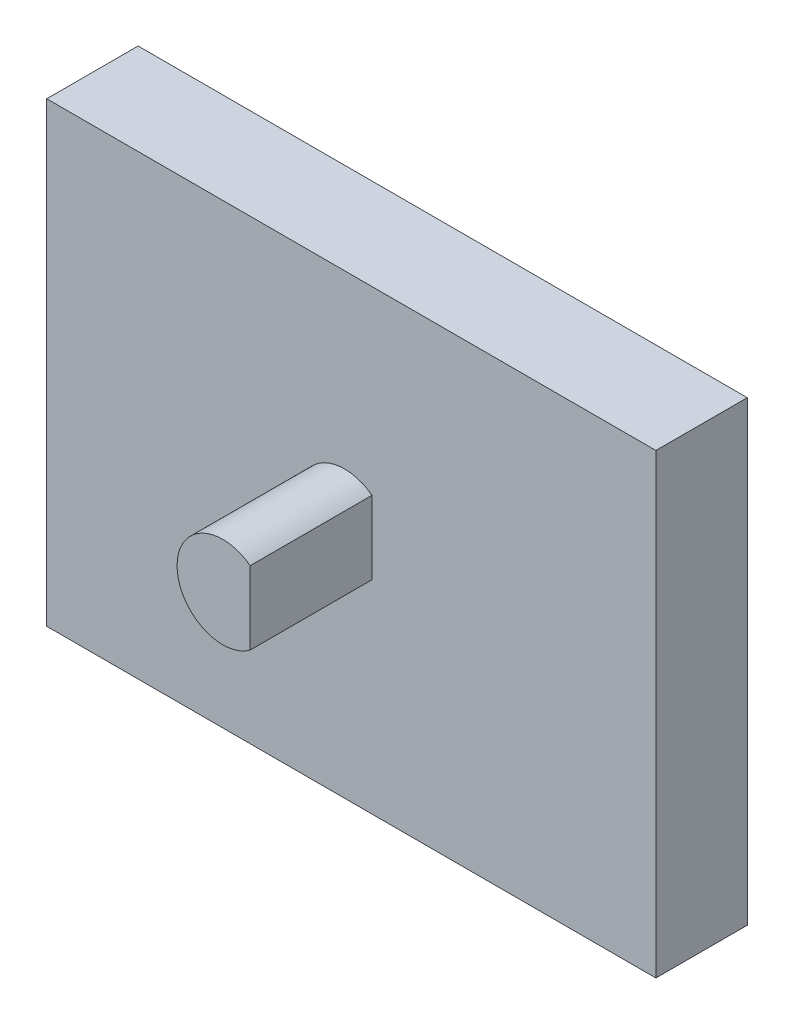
ISO-10303-21;
HEADER;
FILE_DESCRIPTION(('STEP AP214'),'2;1');
FILE_NAME('part.step','',(''),(''),'','','');
FILE_SCHEMA(('AUTOMOTIVE_DESIGN { 1 0 10303 214 1 1 1 1 }'));
ENDSEC;
DATA;
#1=APPLICATION_CONTEXT('core data for automotive mechanical design processes');
#2=APPLICATION_PROTOCOL_DEFINITION('international standard','automotive_design',2000,#1);
#3=PRODUCT_CONTEXT('',#1,'mechanical');
#4=PRODUCT('Part','Part','',(#3));
#5=PRODUCT_RELATED_PRODUCT_CATEGORY('part','',(#4));
#6=PRODUCT_DEFINITION_FORMATION('','',#4);
#7=PRODUCT_DEFINITION_CONTEXT('part definition',#1,'design');
#8=PRODUCT_DEFINITION('design','',#6,#7);
#9=PRODUCT_DEFINITION_SHAPE('','',#8);
#10=(LENGTH_UNIT() NAMED_UNIT(*) SI_UNIT(.MILLI.,.METRE.));
#11=(NAMED_UNIT(*) PLANE_ANGLE_UNIT() SI_UNIT($,.RADIAN.));
#12=(NAMED_UNIT(*) SI_UNIT($,.STERADIAN.) SOLID_ANGLE_UNIT());
#13=UNCERTAINTY_MEASURE_WITH_UNIT(LENGTH_MEASURE(1.E-05),#10,'distance_accuracy_value','');
#14=(GEOMETRIC_REPRESENTATION_CONTEXT(3) GLOBAL_UNCERTAINTY_ASSIGNED_CONTEXT((#13)) GLOBAL_UNIT_ASSIGNED_CONTEXT((#10,
#11,#12)) REPRESENTATION_CONTEXT('',''));
#15=CARTESIAN_POINT('',(0.,0.,0.));
#16=DIRECTION('',(0.,0.,1.));
#17=DIRECTION('',(1.,0.,0.));
#18=AXIS2_PLACEMENT_3D('',#15,#16,#17);
#19=CARTESIAN_POINT('',(0.,75.,15.));
#20=DIRECTION('',(0.,0.,-1.));
#21=DIRECTION('',(-1.,0.,0.));
#22=AXIS2_PLACEMENT_3D('',#19,#20,#21);
#23=PLANE('',#22);
#24=DIRECTION('',(0.,-1.,0.));
#25=VECTOR('',#24,1.);
#26=CARTESIAN_POINT('',(0.,0.,15.));
#27=LINE('',#26,#25);
#28=CARTESIAN_POINT('',(0.,75.,15.));
#29=VERTEX_POINT('',#28);
#30=CARTESIAN_POINT('',(0.,0.,15.));
#31=VERTEX_POINT('',#30);
#32=EDGE_CURVE('E110',#29,#31,#27,.T.);
#33=ORIENTED_EDGE('',*,*,#32,.T.);
#34=DIRECTION('',(1.,0.,0.));
#35=VECTOR('',#34,1.);
#36=CARTESIAN_POINT('',(0.,0.,15.));
#37=LINE('',#36,#35);
#38=CARTESIAN_POINT('',(100.,0.,15.));
#39=VERTEX_POINT('',#38);
#40=EDGE_CURVE('E112',#31,#39,#37,.T.);
#41=ORIENTED_EDGE('',*,*,#40,.T.);
#42=DIRECTION('',(0.,1.,0.));
#43=VECTOR('',#42,1.);
#44=CARTESIAN_POINT('',(100.,0.,15.));
#45=LINE('',#44,#43);
#46=CARTESIAN_POINT('',(100.,75.,15.));
#47=VERTEX_POINT('',#46);
#48=EDGE_CURVE('E114',#39,#47,#45,.T.);
#49=ORIENTED_EDGE('',*,*,#48,.T.);
#50=DIRECTION('',(-1.,0.,0.));
#51=VECTOR('',#50,1.);
#52=CARTESIAN_POINT('',(0.,75.,15.));
#53=LINE('',#52,#51);
#54=EDGE_CURVE('E54',#47,#29,#53,.T.);
#55=ORIENTED_EDGE('',*,*,#54,.T.);
#56=EDGE_LOOP('',(#33,#41,#49,#55));
#57=FACE_BOUND('',#56,.T.);
#58=CARTESIAN_POINT('',(48.896428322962,39.3206259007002,15.));
#59=DIRECTION('',(0.,0.,-1.));
#60=DIRECTION('',(-1.,0.,0.));
#61=AXIS2_PLACEMENT_3D('',#58,#59,#60);
#62=CIRCLE('',#61,7.5);
#63=CARTESIAN_POINT('',(53.396428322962,45.3206259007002,15.));
#64=VERTEX_POINT('',#63);
#65=CARTESIAN_POINT('',(53.396428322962,33.3206259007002,15.));
#66=VERTEX_POINT('',#65);
#67=EDGE_CURVE('E11',#64,#66,#62,.F.);
#68=ORIENTED_EDGE('',*,*,#67,.F.);
#69=DIRECTION('',(0.,-1.,0.));
#70=VECTOR('',#69,1.);
#71=CARTESIAN_POINT('',(53.396428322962,45.3206259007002,15.));
#72=LINE('',#71,#70);
#73=EDGE_CURVE('E90',#64,#66,#72,.T.);
#74=ORIENTED_EDGE('',*,*,#73,.T.);
#75=EDGE_LOOP('',(#68,#74));
#76=FACE_BOUND('',#75,.T.);
#77=ADVANCED_FACE('F31',(#57,#76),#23,.F.);
#78=CARTESIAN_POINT('',(0.,0.,15.));
#79=DIRECTION('',(1.,0.,0.));
#80=DIRECTION('',(0.,0.,-1.));
#81=AXIS2_PLACEMENT_3D('',#78,#79,#80);
#82=PLANE('',#81);
#83=DIRECTION('',(0.,-1.,0.));
#84=VECTOR('',#83,1.);
#85=CARTESIAN_POINT('',(0.,0.,0.));
#86=LINE('',#85,#84);
#87=CARTESIAN_POINT('',(0.,75.,0.));
#88=VERTEX_POINT('',#87);
#89=CARTESIAN_POINT('',(0.,0.,0.));
#90=VERTEX_POINT('',#89);
#91=EDGE_CURVE('E98',#88,#90,#86,.T.);
#92=ORIENTED_EDGE('',*,*,#91,.T.);
#93=DIRECTION('',(0.,0.,-1.));
#94=VECTOR('',#93,1.);
#95=CARTESIAN_POINT('',(0.,0.,15.));
#96=LINE('',#95,#94);
#97=EDGE_CURVE('E39',#31,#90,#96,.T.);
#98=ORIENTED_EDGE('',*,*,#97,.F.);
#99=ORIENTED_EDGE('',*,*,#32,.F.);
#100=DIRECTION('',(0.,0.,-1.));
#101=VECTOR('',#100,1.);
#102=CARTESIAN_POINT('',(0.,75.,15.));
#103=LINE('',#102,#101);
#104=EDGE_CURVE('E117',#29,#88,#103,.T.);
#105=ORIENTED_EDGE('',*,*,#104,.T.);
#106=EDGE_LOOP('',(#92,#98,#99,#105));
#107=FACE_BOUND('',#106,.T.);
#108=ADVANCED_FACE('F33',(#107),#82,.F.);
#109=CARTESIAN_POINT('',(0.,0.,15.));
#110=DIRECTION('',(0.,1.,0.));
#111=DIRECTION('',(0.,0.,1.));
#112=AXIS2_PLACEMENT_3D('',#109,#110,#111);
#113=PLANE('',#112);
#114=DIRECTION('',(1.,0.,0.));
#115=VECTOR('',#114,1.);
#116=CARTESIAN_POINT('',(0.,0.,0.));
#117=LINE('',#116,#115);
#118=CARTESIAN_POINT('',(100.,0.,0.));
#119=VERTEX_POINT('',#118);
#120=EDGE_CURVE('E101',#90,#119,#117,.T.);
#121=ORIENTED_EDGE('',*,*,#120,.T.);
#122=DIRECTION('',(0.,0.,-1.));
#123=VECTOR('',#122,1.);
#124=CARTESIAN_POINT('',(100.,0.,15.));
#125=LINE('',#124,#123);
#126=EDGE_CURVE('E123',#39,#119,#125,.T.);
#127=ORIENTED_EDGE('',*,*,#126,.F.);
#128=ORIENTED_EDGE('',*,*,#40,.F.);
#129=ORIENTED_EDGE('',*,*,#97,.T.);
#130=EDGE_LOOP('',(#121,#127,#128,#129));
#131=FACE_BOUND('',#130,.T.);
#132=ADVANCED_FACE('F128',(#131),#113,.F.);
#133=CARTESIAN_POINT('',(100.,0.,15.));
#134=DIRECTION('',(-1.,0.,0.));
#135=DIRECTION('',(0.,0.,1.));
#136=AXIS2_PLACEMENT_3D('',#133,#134,#135);
#137=PLANE('',#136);
#138=DIRECTION('',(0.,1.,0.));
#139=VECTOR('',#138,1.);
#140=CARTESIAN_POINT('',(100.,0.,0.));
#141=LINE('',#140,#139);
#142=CARTESIAN_POINT('',(100.,75.,0.));
#143=VERTEX_POINT('',#142);
#144=EDGE_CURVE('E106',#119,#143,#141,.T.);
#145=ORIENTED_EDGE('',*,*,#144,.T.);
#146=DIRECTION('',(0.,0.,-1.));
#147=VECTOR('',#146,1.);
#148=CARTESIAN_POINT('',(100.,75.,15.));
#149=LINE('',#148,#147);
#150=EDGE_CURVE('E120',#47,#143,#149,.T.);
#151=ORIENTED_EDGE('',*,*,#150,.F.);
#152=ORIENTED_EDGE('',*,*,#48,.F.);
#153=ORIENTED_EDGE('',*,*,#126,.T.);
#154=EDGE_LOOP('',(#145,#151,#152,#153));
#155=FACE_BOUND('',#154,.T.);
#156=ADVANCED_FACE('F139',(#155),#137,.F.);
#157=CARTESIAN_POINT('',(0.,75.,15.));
#158=DIRECTION('',(0.,-1.,0.));
#159=DIRECTION('',(0.,0.,-1.));
#160=AXIS2_PLACEMENT_3D('',#157,#158,#159);
#161=PLANE('',#160);
#162=DIRECTION('',(-1.,0.,0.));
#163=VECTOR('',#162,1.);
#164=CARTESIAN_POINT('',(0.,75.,0.));
#165=LINE('',#164,#163);
#166=EDGE_CURVE('E108',#143,#88,#165,.T.);
#167=ORIENTED_EDGE('',*,*,#166,.T.);
#168=ORIENTED_EDGE('',*,*,#104,.F.);
#169=ORIENTED_EDGE('',*,*,#54,.F.);
#170=ORIENTED_EDGE('',*,*,#150,.T.);
#171=EDGE_LOOP('',(#167,#168,#169,#170));
#172=FACE_BOUND('',#171,.T.);
#173=ADVANCED_FACE('F142',(#172),#161,.F.);
#174=CARTESIAN_POINT('',(0.,75.,0.));
#175=DIRECTION('',(0.,0.,-1.));
#176=DIRECTION('',(-1.,0.,0.));
#177=AXIS2_PLACEMENT_3D('',#174,#175,#176);
#178=PLANE('',#177);
#179=ORIENTED_EDGE('',*,*,#91,.F.);
#180=ORIENTED_EDGE('',*,*,#166,.F.);
#181=ORIENTED_EDGE('',*,*,#144,.F.);
#182=ORIENTED_EDGE('',*,*,#120,.F.);
#183=EDGE_LOOP('',(#179,#180,#181,#182));
#184=FACE_BOUND('',#183,.T.);
#185=ADVANCED_FACE('F135',(#184),#178,.T.);
#186=CARTESIAN_POINT('',(48.896428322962,39.3206259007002,35.));
#187=DIRECTION('',(0.,0.,-1.));
#188=DIRECTION('',(-1.,0.,0.));
#189=AXIS2_PLACEMENT_3D('',#186,#187,#188);
#190=CYLINDRICAL_SURFACE('',#189,7.5);
#191=CARTESIAN_POINT('',(48.896428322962,39.3206259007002,35.));
#192=DIRECTION('',(0.,0.,1.));
#193=DIRECTION('',(1.,0.,0.));
#194=AXIS2_PLACEMENT_3D('',#191,#192,#193);
#195=CIRCLE('',#194,7.5);
#196=CARTESIAN_POINT('',(53.396428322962,45.3206259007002,35.));
#197=VERTEX_POINT('',#196);
#198=CARTESIAN_POINT('',(53.396428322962,33.3206259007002,35.));
#199=VERTEX_POINT('',#198);
#200=EDGE_CURVE('E94',#197,#199,#195,.T.);
#201=ORIENTED_EDGE('',*,*,#200,.F.);
#202=DIRECTION('',(0.,0.,1.));
#203=VECTOR('',#202,1.);
#204=CARTESIAN_POINT('',(53.396428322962,45.3206259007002,15.));
#205=LINE('',#204,#203);
#206=EDGE_CURVE('E46',#64,#197,#205,.T.);
#207=ORIENTED_EDGE('',*,*,#206,.F.);
#208=ORIENTED_EDGE('',*,*,#67,.T.);
#209=DIRECTION('',(0.,0.,1.));
#210=VECTOR('',#209,1.);
#211=CARTESIAN_POINT('',(53.396428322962,33.3206259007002,15.));
#212=LINE('',#211,#210);
#213=EDGE_CURVE('E85',#66,#199,#212,.T.);
#214=ORIENTED_EDGE('',*,*,#213,.T.);
#215=EDGE_LOOP('',(#201,#207,#208,#214));
#216=FACE_BOUND('',#215,.T.);
#217=ADVANCED_FACE('F93',(#216),#190,.T.);
#218=CARTESIAN_POINT('',(48.896428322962,39.3206259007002,35.));
#219=DIRECTION('',(0.,0.,1.));
#220=DIRECTION('',(1.,0.,0.));
#221=AXIS2_PLACEMENT_3D('',#218,#219,#220);
#222=PLANE('',#221);
#223=DIRECTION('',(0.,-1.,0.));
#224=VECTOR('',#223,1.);
#225=CARTESIAN_POINT('',(53.396428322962,45.3206259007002,35.));
#226=LINE('',#225,#224);
#227=EDGE_CURVE('E82',#197,#199,#226,.T.);
#228=ORIENTED_EDGE('',*,*,#227,.F.);
#229=ORIENTED_EDGE('',*,*,#200,.T.);
#230=EDGE_LOOP('',(#228,#229));
#231=FACE_BOUND('',#230,.T.);
#232=ADVANCED_FACE('F97',(#231),#222,.T.);
#233=CARTESIAN_POINT('',(53.396428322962,45.3206259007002,15.));
#234=DIRECTION('',(-1.,0.,0.));
#235=DIRECTION('',(0.,0.,1.));
#236=AXIS2_PLACEMENT_3D('',#233,#234,#235);
#237=PLANE('',#236);
#238=ORIENTED_EDGE('',*,*,#227,.T.);
#239=ORIENTED_EDGE('',*,*,#213,.F.);
#240=ORIENTED_EDGE('',*,*,#73,.F.);
#241=ORIENTED_EDGE('',*,*,#206,.T.);
#242=EDGE_LOOP('',(#238,#239,#240,#241));
#243=FACE_BOUND('',#242,.T.);
#244=ADVANCED_FACE('F84',(#243),#237,.F.);
#245=CLOSED_SHELL('',(#77,#108,#132,#156,#173,#185,#217,#232,#244));
#246=MANIFOLD_SOLID_BREP('B2',#245);
#247=ADVANCED_BREP_SHAPE_REPRESENTATION('',(#18,#246),#14);
#248=SHAPE_DEFINITION_REPRESENTATION(#9,#247);
ENDSEC;
END-ISO-10303-21;
